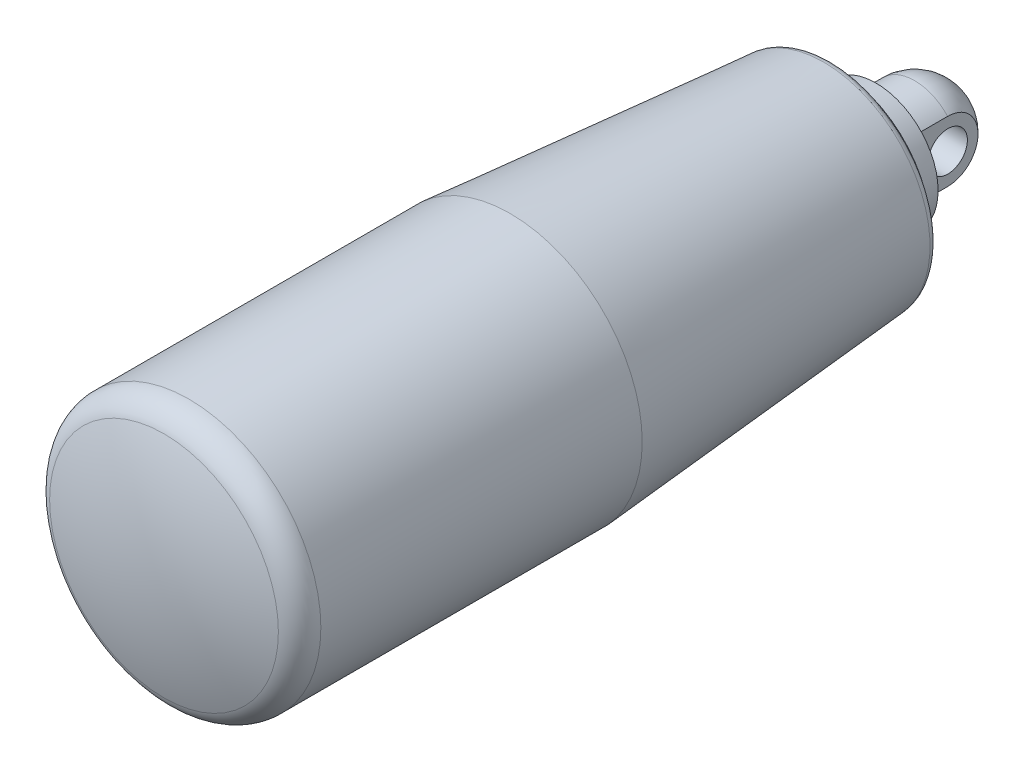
ISO-10303-21;
HEADER;
FILE_DESCRIPTION(('STEP AP214'),'2;1');
FILE_NAME('part.step','',(''),(''),'','','');
FILE_SCHEMA(('AUTOMOTIVE_DESIGN { 1 0 10303 214 1 1 1 1 }'));
ENDSEC;
DATA;
#1=APPLICATION_CONTEXT('core data for automotive mechanical design processes');
#2=APPLICATION_PROTOCOL_DEFINITION('international standard','automotive_design',2000,#1);
#3=PRODUCT_CONTEXT('',#1,'mechanical');
#4=PRODUCT('Part','Part','',(#3));
#5=PRODUCT_RELATED_PRODUCT_CATEGORY('part','',(#4));
#6=PRODUCT_DEFINITION_FORMATION('','',#4);
#7=PRODUCT_DEFINITION_CONTEXT('part definition',#1,'design');
#8=PRODUCT_DEFINITION('design','',#6,#7);
#9=PRODUCT_DEFINITION_SHAPE('','',#8);
#10=(LENGTH_UNIT() NAMED_UNIT(*) SI_UNIT(.MILLI.,.METRE.));
#11=(NAMED_UNIT(*) PLANE_ANGLE_UNIT() SI_UNIT($,.RADIAN.));
#12=(NAMED_UNIT(*) SI_UNIT($,.STERADIAN.) SOLID_ANGLE_UNIT());
#13=UNCERTAINTY_MEASURE_WITH_UNIT(LENGTH_MEASURE(1.E-05),#10,'distance_accuracy_value','');
#14=(GEOMETRIC_REPRESENTATION_CONTEXT(3) GLOBAL_UNCERTAINTY_ASSIGNED_CONTEXT((#13)) GLOBAL_UNIT_ASSIGNED_CONTEXT((#10,
#11,#12)) REPRESENTATION_CONTEXT('',''));
#15=CARTESIAN_POINT('',(0.,0.,0.));
#16=DIRECTION('',(0.,0.,1.));
#17=DIRECTION('',(1.,0.,0.));
#18=AXIS2_PLACEMENT_3D('',#15,#16,#17);
#19=CARTESIAN_POINT('',(16.,0.,0.));
#20=DIRECTION('',(1.,0.,0.));
#21=DIRECTION('',(0.,1.,0.));
#22=AXIS2_PLACEMENT_3D('',#19,#20,#21);
#23=CYLINDRICAL_SURFACE('',#22,1.6);
#24=CARTESIAN_POINT('',(-2.6875,0.,0.));
#25=DIRECTION('',(1.,0.,0.));
#26=DIRECTION('',(0.,1.,0.));
#27=AXIS2_PLACEMENT_3D('',#24,#25,#26);
#28=CIRCLE('',#27,1.6);
#29=CARTESIAN_POINT('',(-2.6875,1.6,0.));
#30=VERTEX_POINT('',#29);
#31=EDGE_CURVE('E86',#30,#30,#28,.F.);
#32=ORIENTED_EDGE('',*,*,#31,.T.);
#33=EDGE_LOOP('',(#32));
#34=FACE_BOUND('',#33,.T.);
#35=CARTESIAN_POINT('',(2.6875,0.,0.));
#36=DIRECTION('',(1.,0.,0.));
#37=DIRECTION('',(0.,1.,0.));
#38=AXIS2_PLACEMENT_3D('',#35,#36,#37);
#39=CIRCLE('',#38,1.6);
#40=CARTESIAN_POINT('',(2.6875,1.6,0.));
#41=VERTEX_POINT('',#40);
#42=EDGE_CURVE('E19',#41,#41,#39,.F.);
#43=ORIENTED_EDGE('',*,*,#42,.F.);
#44=EDGE_LOOP('',(#43));
#45=FACE_BOUND('',#44,.T.);
#46=ADVANCED_FACE('F14',(#34,#45),#23,.F.);
#47=CARTESIAN_POINT('',(0.0099999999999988,0.,0.00999999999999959));
#48=DIRECTION('',(0.,-1.,0.));
#49=DIRECTION('',(1.,0.,0.));
#50=AXIS2_PLACEMENT_3D('',#47,#48,#49);
#51=CIRCLE('',#50,3.645);
#52=TRIMMED_CURVE('',#51,(PARAMETER_VALUE(-1.57353981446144)),
(PARAMETER_VALUE(1.57353981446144)),.T.,.PARAMETER.);
#53=CARTESIAN_POINT('',(0.,0.,0.00999999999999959));
#54=DIRECTION('',(0.,0.,1.));
#55=AXIS1_PLACEMENT('',#53,#54);
#56=SURFACE_OF_REVOLUTION('',#52,#55);
#57=CARTESIAN_POINT('',(0.,0.,-3.63498628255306));
#58=VERTEX_POINT('',#57);
#59=VERTEX_LOOP('',#58);
#60=FACE_BOUND('',#59,.T.);
#61=CARTESIAN_POINT('',(0.,0.,0.00999999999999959));
#62=DIRECTION('',(0.,0.,-1.));
#63=DIRECTION('',(0.,1.,0.));
#64=AXIS2_PLACEMENT_3D('',#61,#62,#63);
#65=CIRCLE('',#64,3.655);
#66=CARTESIAN_POINT('',(2.6875,2.47716950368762,0.00999999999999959));
#67=VERTEX_POINT('',#66);
#68=CARTESIAN_POINT('',(-2.6875,2.47716950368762,0.00999999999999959));
#69=VERTEX_POINT('',#68);
#70=EDGE_CURVE('E64',#67,#69,#65,.F.);
#71=ORIENTED_EDGE('',*,*,#70,.F.);
#72=CARTESIAN_POINT('',(2.6875,-2.47716950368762,0.00999999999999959));
#73=CARTESIAN_POINT('',(2.6875,-2.47716906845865,-0.059538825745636));
#74=CARTESIAN_POINT('',(2.6875,-2.47423149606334,-0.129044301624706));
#75=CARTESIAN_POINT('',(2.6875,-2.46251252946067,-0.267557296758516));
#76=CARTESIAN_POINT('',(2.6875,-2.45373142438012,-0.336564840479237));
#77=CARTESIAN_POINT('',(2.6875,-2.41870595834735,-0.541981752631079));
#78=CARTESIAN_POINT('',(2.6875,-2.38377921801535,-0.677013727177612));
#79=CARTESIAN_POINT('',(2.6875,-2.2917478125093,-0.939287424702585));
#80=CARTESIAN_POINT('',(2.6875,-2.23463300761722,-1.06652555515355));
#81=CARTESIAN_POINT('',(2.6875,-2.09986188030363,-1.30960204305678));
#82=CARTESIAN_POINT('',(2.6875,-2.02220951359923,-1.42544258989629));
#83=CARTESIAN_POINT('',(2.6875,-1.84856279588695,-1.64246042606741));
#84=CARTESIAN_POINT('',(2.6875,-1.75256642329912,-1.74363609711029));
#85=CARTESIAN_POINT('',(2.6875,-1.54495282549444,-1.92847406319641));
#86=CARTESIAN_POINT('',(2.6875,-1.43333317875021,-2.01213363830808));
#87=CARTESIAN_POINT('',(2.6875,-1.19752221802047,-2.15964969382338));
#88=CARTESIAN_POINT('',(2.6875,-1.07331690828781,-2.22348379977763));
#89=CARTESIAN_POINT('',(2.6875,-0.815973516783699,-2.32943119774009));
#90=CARTESIAN_POINT('',(2.6875,-0.68283589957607,-2.37154561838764));
#91=CARTESIAN_POINT('',(2.6875,-0.411148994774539,-2.43294193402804));
#92=CARTESIAN_POINT('',(2.6875,-0.272590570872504,-2.45218340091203));
#93=CARTESIAN_POINT('',(2.6875,0.00579485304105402,-2.46716470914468));
#94=CARTESIAN_POINT('',(2.6875,0.145621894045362,-2.46290378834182));
#95=CARTESIAN_POINT('',(2.6875,0.422756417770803,-2.43097653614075));
#96=CARTESIAN_POINT('',(2.6875,0.56006052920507,-2.40328092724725));
#97=CARTESIAN_POINT('',(2.6875,0.828064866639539,-2.32521746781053));
#98=CARTESIAN_POINT('',(2.6875,0.958765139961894,-2.2748497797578));
#99=CARTESIAN_POINT('',(2.6875,1.20976277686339,-2.15289122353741));
#100=CARTESIAN_POINT('',(2.6875,1.33006623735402,-2.08131290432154));
#101=CARTESIAN_POINT('',(2.6875,1.55691443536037,-1.91894426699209));
#102=CARTESIAN_POINT('',(2.6875,1.66345996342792,-1.8281550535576));
#103=CARTESIAN_POINT('',(2.6875,1.8595640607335,-1.63012675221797));
#104=CARTESIAN_POINT('',(2.6875,1.94915423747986,-1.52291896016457));
#105=CARTESIAN_POINT('',(2.6875,2.10906212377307,-1.29492415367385));
#106=CARTESIAN_POINT('',(2.6875,2.17937382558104,-1.17413292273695));
#107=CARTESIAN_POINT('',(2.6875,2.29862404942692,-0.922573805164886));
#108=CARTESIAN_POINT('',(2.6875,2.34758013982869,-0.791814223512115));
#109=CARTESIAN_POINT('',(2.6875,2.42275064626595,-0.524030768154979));
#110=CARTESIAN_POINT('',(2.6875,2.44900001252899,-0.387016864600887));
#111=CARTESIAN_POINT('',(2.6875,2.46809908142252,-0.205911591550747));
#112=CARTESIAN_POINT('',(2.6875,2.47150227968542,-0.162761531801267));
#113=CARTESIAN_POINT('',(2.6875,2.47603438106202,-0.076413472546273));
#114=CARTESIAN_POINT('',(2.6875,2.47716702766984,-0.0332156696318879));
#115=CARTESIAN_POINT('',(2.6875,2.47716950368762,0.00999999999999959));
#116=B_SPLINE_CURVE_WITH_KNOTS('',3,(#72,#73,#74,#75,#76,#77,#78,#79,#80,#81,#82,#83,#84,#85,
#86,#87,#88,#89,#90,#91,#92,#93,#94,#95,#96,#97,#98,#99,#100,#101,#102,#103,#104,#105,#106,#107,
#108,#109,#110,#111,#112,#113,#114,#115),.UNSPECIFIED.,.F.,.F.,(4,2,2,2,2,2,2,2,2,2,2,2,2,2,2,2,
2,2,2,2,2,4),(0.,0.208488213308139,0.416966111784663,0.833245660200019,1.24971566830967,
1.66610551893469,2.08254128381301,2.49904166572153,2.91601040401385,3.33295747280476,
3.75064040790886,4.1683368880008,4.58655597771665,5.00477207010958,5.42274122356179,
5.84068634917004,6.25784451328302,6.67513252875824,7.09207660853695,7.5083777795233,
7.63818841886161,7.76778486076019),.UNSPECIFIED.);
#117=CARTESIAN_POINT('',(2.6875,-2.47716950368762,0.00999999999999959));
#118=VERTEX_POINT('',#117);
#119=EDGE_CURVE('E57',#118,#67,#116,.T.);
#120=ORIENTED_EDGE('',*,*,#119,.F.);
#121=CARTESIAN_POINT('',(0.,0.,0.00999999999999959));
#122=DIRECTION('',(0.,0.,-1.));
#123=DIRECTION('',(0.,1.,0.));
#124=AXIS2_PLACEMENT_3D('',#121,#122,#123);
#125=CIRCLE('',#124,3.655);
#126=CARTESIAN_POINT('',(-2.6875,-2.47716950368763,0.00999999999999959));
#127=VERTEX_POINT('',#126);
#128=EDGE_CURVE('E89',#127,#118,#125,.F.);
#129=ORIENTED_EDGE('',*,*,#128,.F.);
#130=CARTESIAN_POINT('',(-2.6875,-2.47716950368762,0.00999999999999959));
#131=CARTESIAN_POINT('',(-2.6875,-2.47716906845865,-0.0595388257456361));
#132=CARTESIAN_POINT('',(-2.6875,-2.47423149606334,-0.129044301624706));
#133=CARTESIAN_POINT('',(-2.6875,-2.46251252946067,-0.267557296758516));
#134=CARTESIAN_POINT('',(-2.6875,-2.45373142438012,-0.336564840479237));
#135=CARTESIAN_POINT('',(-2.6875,-2.41870595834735,-0.541981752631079));
#136=CARTESIAN_POINT('',(-2.6875,-2.38377921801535,-0.677013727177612));
#137=CARTESIAN_POINT('',(-2.6875,-2.2917478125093,-0.939287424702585));
#138=CARTESIAN_POINT('',(-2.6875,-2.23463300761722,-1.06652555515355));
#139=CARTESIAN_POINT('',(-2.6875,-2.09986188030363,-1.30960204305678));
#140=CARTESIAN_POINT('',(-2.6875,-2.02220951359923,-1.42544258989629));
#141=CARTESIAN_POINT('',(-2.6875,-1.84856279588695,-1.64246042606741));
#142=CARTESIAN_POINT('',(-2.6875,-1.75256642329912,-1.74363609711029));
#143=CARTESIAN_POINT('',(-2.6875,-1.54495282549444,-1.92847406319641));
#144=CARTESIAN_POINT('',(-2.6875,-1.43333317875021,-2.01213363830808));
#145=CARTESIAN_POINT('',(-2.6875,-1.19752221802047,-2.15964969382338));
#146=CARTESIAN_POINT('',(-2.6875,-1.07331690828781,-2.22348379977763));
#147=CARTESIAN_POINT('',(-2.6875,-0.8159735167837,-2.32943119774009));
#148=CARTESIAN_POINT('',(-2.6875,-0.682835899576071,-2.37154561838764));
#149=CARTESIAN_POINT('',(-2.6875,-0.41114899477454,-2.43294193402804));
#150=CARTESIAN_POINT('',(-2.6875,-0.272590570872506,-2.45218340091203));
#151=CARTESIAN_POINT('',(-2.6875,0.00579485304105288,-2.46716470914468));
#152=CARTESIAN_POINT('',(-2.6875,0.145621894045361,-2.46290378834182));
#153=CARTESIAN_POINT('',(-2.6875,0.422756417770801,-2.43097653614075));
#154=CARTESIAN_POINT('',(-2.6875,0.560060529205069,-2.40328092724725));
#155=CARTESIAN_POINT('',(-2.6875,0.828064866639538,-2.32521746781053));
#156=CARTESIAN_POINT('',(-2.6875,0.958765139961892,-2.2748497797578));
#157=CARTESIAN_POINT('',(-2.6875,1.20976277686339,-2.15289122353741));
#158=CARTESIAN_POINT('',(-2.6875,1.33006623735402,-2.08131290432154));
#159=CARTESIAN_POINT('',(-2.6875,1.55691443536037,-1.91894426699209));
#160=CARTESIAN_POINT('',(-2.6875,1.66345996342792,-1.8281550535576));
#161=CARTESIAN_POINT('',(-2.6875,1.8595640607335,-1.63012675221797));
#162=CARTESIAN_POINT('',(-2.6875,1.94915423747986,-1.52291896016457));
#163=CARTESIAN_POINT('',(-2.6875,2.10906212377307,-1.29492415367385));
#164=CARTESIAN_POINT('',(-2.6875,2.17937382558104,-1.17413292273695));
#165=CARTESIAN_POINT('',(-2.6875,2.29862404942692,-0.922573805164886));
#166=CARTESIAN_POINT('',(-2.6875,2.34758013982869,-0.791814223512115));
#167=CARTESIAN_POINT('',(-2.6875,2.42275064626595,-0.524030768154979));
#168=CARTESIAN_POINT('',(-2.6875,2.44900001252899,-0.387016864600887));
#169=CARTESIAN_POINT('',(-2.6875,2.46809908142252,-0.205911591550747));
#170=CARTESIAN_POINT('',(-2.6875,2.47150227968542,-0.162761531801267));
#171=CARTESIAN_POINT('',(-2.6875,2.47603438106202,-0.076413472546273));
#172=CARTESIAN_POINT('',(-2.6875,2.47716702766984,-0.0332156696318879));
#173=CARTESIAN_POINT('',(-2.6875,2.47716950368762,0.00999999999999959));
#174=B_SPLINE_CURVE_WITH_KNOTS('',3,(#130,#131,#132,#133,#134,#135,#136,#137,#138,#139,#140,
#141,#142,#143,#144,#145,#146,#147,#148,#149,#150,#151,#152,#153,#154,#155,#156,#157,#158,#159,
#160,#161,#162,#163,#164,#165,#166,#167,#168,#169,#170,#171,#172,#173),.UNSPECIFIED.,.F.,.F.,(4,
2,2,2,2,2,2,2,2,2,2,2,2,2,2,2,2,2,2,2,2,4),(0.,0.208488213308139,0.416966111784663,
0.833245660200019,1.24971566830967,1.66610551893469,2.08254128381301,2.49904166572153,
2.91601040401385,3.33295747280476,3.75064040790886,4.1683368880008,4.58655597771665,
5.00477207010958,5.42274122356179,5.84068634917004,6.25784451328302,6.67513252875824,
7.09207660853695,7.5083777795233,7.63818841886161,7.76778486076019),.UNSPECIFIED.);
#175=EDGE_CURVE('E67',#127,#69,#174,.T.);
#176=ORIENTED_EDGE('',*,*,#175,.T.);
#177=EDGE_LOOP('',(#71,#120,#129,#176));
#178=FACE_BOUND('',#177,.T.);
#179=ADVANCED_FACE('F16',(#60,#178),#56,.T.);
#180=CARTESIAN_POINT('',(2.6875,0.,-8.25));
#181=DIRECTION('',(1.,0.,0.));
#182=DIRECTION('',(0.,1.,0.));
#183=AXIS2_PLACEMENT_3D('',#180,#181,#182);
#184=PLANE('',#183);
#185=DIRECTION('',(0.,0.,-1.));
#186=VECTOR('',#185,1.);
#187=CARTESIAN_POINT('',(2.6875,-2.47716950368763,-3.63498628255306));
#188=LINE('',#187,#186);
#189=CARTESIAN_POINT('',(2.6875,-2.47716950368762,3.15));
#190=VERTEX_POINT('',#189);
#191=EDGE_CURVE('E87',#118,#190,#188,.F.);
#192=ORIENTED_EDGE('',*,*,#191,.F.);
#193=ORIENTED_EDGE('',*,*,#119,.T.);
#194=DIRECTION('',(0.,0.,-1.));
#195=VECTOR('',#194,1.);
#196=CARTESIAN_POINT('',(2.6875,2.47716950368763,-3.63498628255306));
#197=LINE('',#196,#195);
#198=CARTESIAN_POINT('',(2.6875,2.47716950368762,3.15));
#199=VERTEX_POINT('',#198);
#200=EDGE_CURVE('E70',#199,#67,#197,.T.);
#201=ORIENTED_EDGE('',*,*,#200,.F.);
#202=DIRECTION('',(0.,-1.,0.));
#203=VECTOR('',#202,1.);
#204=CARTESIAN_POINT('',(2.6875,0.,3.15));
#205=LINE('',#204,#203);
#206=EDGE_CURVE('E69',#199,#190,#205,.T.);
#207=ORIENTED_EDGE('',*,*,#206,.T.);
#208=EDGE_LOOP('',(#192,#193,#201,#207));
#209=FACE_BOUND('',#208,.T.);
#210=ORIENTED_EDGE('',*,*,#42,.T.);
#211=EDGE_LOOP('',(#210));
#212=FACE_BOUND('',#211,.T.);
#213=ADVANCED_FACE('F62',(#209,#212),#184,.T.);
#214=CARTESIAN_POINT('',(0.,0.,-3.63498628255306));
#215=DIRECTION('',(0.,0.,-1.));
#216=DIRECTION('',(0.,1.,0.));
#217=AXIS2_PLACEMENT_3D('',#214,#215,#216);
#218=CYLINDRICAL_SURFACE('',#217,3.655);
#219=ORIENTED_EDGE('',*,*,#128,.T.);
#220=ORIENTED_EDGE('',*,*,#191,.T.);
#221=CARTESIAN_POINT('',(0.,0.,3.15));
#222=DIRECTION('',(0.,0.,-1.));
#223=DIRECTION('',(0.,1.,0.));
#224=AXIS2_PLACEMENT_3D('',#221,#222,#223);
#225=CIRCLE('',#224,3.655);
#226=CARTESIAN_POINT('',(-2.6875,-2.47716950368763,3.15));
#227=VERTEX_POINT('',#226);
#228=EDGE_CURVE('E111',#190,#227,#225,.T.);
#229=ORIENTED_EDGE('',*,*,#228,.T.);
#230=DIRECTION('',(0.,0.,1.));
#231=VECTOR('',#230,1.);
#232=CARTESIAN_POINT('',(-2.6875,-2.47716950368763,-8.25));
#233=LINE('',#232,#231);
#234=EDGE_CURVE('E83',#227,#127,#233,.F.);
#235=ORIENTED_EDGE('',*,*,#234,.T.);
#236=EDGE_LOOP('',(#219,#220,#229,#235));
#237=FACE_BOUND('',#236,.T.);
#238=ADVANCED_FACE('F124',(#237),#218,.T.);
#239=CARTESIAN_POINT('',(-2.6875,0.,-8.25));
#240=DIRECTION('',(1.,0.,0.));
#241=DIRECTION('',(0.,1.,0.));
#242=AXIS2_PLACEMENT_3D('',#239,#240,#241);
#243=PLANE('',#242);
#244=DIRECTION('',(0.,0.,-1.));
#245=VECTOR('',#244,1.);
#246=CARTESIAN_POINT('',(-2.6875,2.47716950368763,-3.63498628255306));
#247=LINE('',#246,#245);
#248=CARTESIAN_POINT('',(-2.6875,2.47716950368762,3.15));
#249=VERTEX_POINT('',#248);
#250=EDGE_CURVE('E78',#69,#249,#247,.F.);
#251=ORIENTED_EDGE('',*,*,#250,.F.);
#252=ORIENTED_EDGE('',*,*,#175,.F.);
#253=ORIENTED_EDGE('',*,*,#234,.F.);
#254=DIRECTION('',(0.,-1.,0.));
#255=VECTOR('',#254,1.);
#256=CARTESIAN_POINT('',(-2.6875,0.,3.15));
#257=LINE('',#256,#255);
#258=EDGE_CURVE('E34',#227,#249,#257,.F.);
#259=ORIENTED_EDGE('',*,*,#258,.T.);
#260=EDGE_LOOP('',(#251,#252,#253,#259));
#261=FACE_BOUND('',#260,.T.);
#262=ORIENTED_EDGE('',*,*,#31,.F.);
#263=EDGE_LOOP('',(#262));
#264=FACE_BOUND('',#263,.T.);
#265=ADVANCED_FACE('F119',(#261,#264),#243,.F.);
#266=CARTESIAN_POINT('',(0.,0.,-3.63498628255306));
#267=DIRECTION('',(0.,0.,-1.));
#268=DIRECTION('',(0.,1.,0.));
#269=AXIS2_PLACEMENT_3D('',#266,#267,#268);
#270=CYLINDRICAL_SURFACE('',#269,3.655);
#271=ORIENTED_EDGE('',*,*,#200,.T.);
#272=ORIENTED_EDGE('',*,*,#70,.T.);
#273=ORIENTED_EDGE('',*,*,#250,.T.);
#274=CARTESIAN_POINT('',(0.,0.,3.15));
#275=DIRECTION('',(0.,0.,-1.));
#276=DIRECTION('',(0.,1.,0.));
#277=AXIS2_PLACEMENT_3D('',#274,#275,#276);
#278=CIRCLE('',#277,3.655);
#279=EDGE_CURVE('E75',#249,#199,#278,.T.);
#280=ORIENTED_EDGE('',*,*,#279,.T.);
#281=EDGE_LOOP('',(#271,#272,#273,#280));
#282=FACE_BOUND('',#281,.T.);
#283=ADVANCED_FACE('F73',(#282),#270,.T.);
#284=CARTESIAN_POINT('',(0.,0.,3.15));
#285=DIRECTION('',(0.,0.,1.));
#286=DIRECTION('',(0.,-1.,0.));
#287=AXIS2_PLACEMENT_3D('',#284,#285,#286);
#288=PLANE('',#287);
#289=ORIENTED_EDGE('',*,*,#258,.F.);
#290=ORIENTED_EDGE('',*,*,#228,.F.);
#291=ORIENTED_EDGE('',*,*,#206,.F.);
#292=ORIENTED_EDGE('',*,*,#279,.F.);
#293=EDGE_LOOP('',(#289,#290,#291,#292));
#294=FACE_BOUND('',#293,.T.);
#295=CARTESIAN_POINT('',(0.,0.,3.14999999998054));
#296=DIRECTION('',(0.,0.,1.));
#297=DIRECTION('',(1.,0.,0.));
#298=AXIS2_PLACEMENT_3D('',#295,#296,#297);
#299=CIRCLE('',#298,5.04917687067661);
#300=CARTESIAN_POINT('',(5.04917687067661,0.,3.14999999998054));
#301=VERTEX_POINT('',#300);
#302=EDGE_CURVE('E107',#301,#301,#299,.T.);
#303=ORIENTED_EDGE('',*,*,#302,.F.);
#304=EDGE_LOOP('',(#303));
#305=FACE_BOUND('',#304,.T.);
#306=ADVANCED_FACE('F210',(#294,#305),#288,.F.);
#307=CARTESIAN_POINT('',(0.,0.,6.2499999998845));
#308=DIRECTION('',(0.,0.,1.));
#309=DIRECTION('',(1.,0.,0.));
#310=AXIS2_PLACEMENT_3D('',#307,#308,#309);
#311=CONICAL_SURFACE('',#310,5.37499999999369,0.104719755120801);
#312=ORIENTED_EDGE('',*,*,#302,.T.);
#313=EDGE_LOOP('',(#312));
#314=FACE_BOUND('',#313,.T.);
#315=CARTESIAN_POINT('',(0.,0.,6.24999999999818));
#316=DIRECTION('',(0.,0.,1.));
#317=DIRECTION('',(1.,0.,0.));
#318=AXIS2_PLACEMENT_3D('',#315,#316,#317);
#319=CIRCLE('',#318,5.37500000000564);
#320=CARTESIAN_POINT('',(5.37500000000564,0.,6.24999999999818));
#321=VERTEX_POINT('',#320);
#322=EDGE_CURVE('E104',#321,#321,#319,.F.);
#323=ORIENTED_EDGE('',*,*,#322,.T.);
#324=EDGE_LOOP('',(#323));
#325=FACE_BOUND('',#324,.T.);
#326=ADVANCED_FACE('F213',(#314,#325),#311,.T.);
#327=CARTESIAN_POINT('',(0.,-5.375,6.25));
#328=DIRECTION('',(0.,0.,1.));
#329=DIRECTION('',(0.,-1.,0.));
#330=AXIS2_PLACEMENT_3D('',#327,#328,#329);
#331=PLANE('',#330);
#332=ORIENTED_EDGE('',*,*,#322,.F.);
#333=EDGE_LOOP('',(#332));
#334=FACE_BOUND('',#333,.T.);
#335=CARTESIAN_POINT('',(0.,0.,6.25));
#336=DIRECTION('',(0.,0.,-1.));
#337=DIRECTION('',(0.,1.,0.));
#338=AXIS2_PLACEMENT_3D('',#335,#336,#337);
#339=CIRCLE('',#338,7.525);
#340=CARTESIAN_POINT('',(0.,7.525,6.25));
#341=VERTEX_POINT('',#340);
#342=EDGE_CURVE('E101',#341,#341,#339,.F.);
#343=ORIENTED_EDGE('',*,*,#342,.F.);
#344=EDGE_LOOP('',(#343));
#345=FACE_BOUND('',#344,.T.);
#346=ADVANCED_FACE('F218',(#334,#345),#331,.F.);
#347=CARTESIAN_POINT('',(0.,0.,62.75));
#348=DIRECTION('',(0.,0.,-1.));
#349=DIRECTION('',(0.,1.,0.));
#350=AXIS2_PLACEMENT_3D('',#347,#348,#349);
#351=CYLINDRICAL_SURFACE('',#350,7.525);
#352=ORIENTED_EDGE('',*,*,#342,.T.);
#353=EDGE_LOOP('',(#352));
#354=FACE_BOUND('',#353,.T.);
#355=CARTESIAN_POINT('',(0.,0.,6.75));
#356=DIRECTION('',(0.,0.,-1.));
#357=DIRECTION('',(0.,1.,0.));
#358=AXIS2_PLACEMENT_3D('',#355,#356,#357);
#359=CIRCLE('',#358,7.525);
#360=CARTESIAN_POINT('',(0.,7.525,6.75));
#361=VERTEX_POINT('',#360);
#362=EDGE_CURVE('E98',#361,#361,#359,.T.);
#363=ORIENTED_EDGE('',*,*,#362,.T.);
#364=EDGE_LOOP('',(#363));
#365=FACE_BOUND('',#364,.T.);
#366=ADVANCED_FACE('F186',(#354,#365),#351,.T.);
#367=CARTESIAN_POINT('',(0.,-7.525,6.75));
#368=DIRECTION('',(0.,0.,1.));
#369=DIRECTION('',(0.,-1.,0.));
#370=AXIS2_PLACEMENT_3D('',#367,#368,#369);
#371=PLANE('',#370);
#372=ORIENTED_EDGE('',*,*,#362,.F.);
#373=EDGE_LOOP('',(#372));
#374=FACE_BOUND('',#373,.T.);
#375=CARTESIAN_POINT('',(0.,0.,6.75000000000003));
#376=DIRECTION('',(0.,0.,1.));
#377=DIRECTION('',(0.,-1.,0.));
#378=AXIS2_PLACEMENT_3D('',#375,#376,#377);
#379=CIRCLE('',#378,7.93973479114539);
#380=CARTESIAN_POINT('',(0.,-7.93973479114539,6.75000000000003));
#381=VERTEX_POINT('',#380);
#382=EDGE_CURVE('E97',#381,#381,#379,.T.);
#383=ORIENTED_EDGE('',*,*,#382,.F.);
#384=EDGE_LOOP('',(#383));
#385=FACE_BOUND('',#384,.T.);
#386=ADVANCED_FACE('F181',(#374,#385),#371,.F.);
#387=CARTESIAN_POINT('',(0.,0.,34.8));
#388=DIRECTION('',(0.,1.,0.));
#389=DIRECTION('',(-1.,0.,0.));
#390=AXIS2_PLACEMENT_3D('',#387,#388,#389);
#391=SPHERICAL_SURFACE('',#390,27.95);
#392=CARTESIAN_POINT('',(0.,0.,61.1515127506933));
#393=DIRECTION('',(0.,0.,1.));
#394=DIRECTION('',(0.,-1.,0.));
#395=AXIS2_PLACEMENT_3D('',#392,#393,#394);
#396=CIRCLE('',#395,9.31666655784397);
#397=CARTESIAN_POINT('',(0.,-9.31666655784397,61.1515127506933));
#398=VERTEX_POINT('',#397);
#399=EDGE_CURVE('E93',#398,#398,#396,.F.);
#400=ORIENTED_EDGE('',*,*,#399,.F.);
#401=EDGE_LOOP('',(#400));
#402=FACE_BOUND('',#401,.T.);
#403=ADVANCED_FACE('F178',(#402),#391,.T.);
#404=CARTESIAN_POINT('',(0.,0.,7.4666666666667));
#405=DIRECTION('',(0.,0.,1.));
#406=DIRECTION('',(0.,-1.,0.));
#407=AXIS2_PLACEMENT_3D('',#404,#405,#406);
#408=TOROIDAL_SURFACE('',#407,7.93973479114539,0.716666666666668);
#409=CARTESIAN_POINT('',(0.,0.,7.408053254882));
#410=DIRECTION('',(0.,0.,1.));
#411=DIRECTION('',(0.,-1.,0.));
#412=AXIS2_PLACEMENT_3D('',#409,#410,#411);
#413=CIRCLE('',#412,8.65400055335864);
#414=CARTESIAN_POINT('',(0.,-8.65400055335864,7.408053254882));
#415=VERTEX_POINT('',#414);
#416=EDGE_CURVE('E96',#415,#415,#413,.T.);
#417=ORIENTED_EDGE('',*,*,#416,.F.);
#418=EDGE_LOOP('',(#417));
#419=FACE_BOUND('',#418,.T.);
#420=ORIENTED_EDGE('',*,*,#382,.T.);
#421=EDGE_LOOP('',(#420));
#422=FACE_BOUND('',#421,.T.);
#423=ADVANCED_FACE('F163',(#419,#422),#408,.T.);
#424=CARTESIAN_POINT('',(0.,0.,59.1244732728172));
#425=DIRECTION('',(0.,0.,1.));
#426=DIRECTION('',(0.,-1.,0.));
#427=AXIS2_PLACEMENT_3D('',#424,#425,#426);
#428=TOROIDAL_SURFACE('',#427,8.6,2.15);
#429=ORIENTED_EDGE('',*,*,#399,.T.);
#430=EDGE_LOOP('',(#429));
#431=FACE_BOUND('',#430,.T.);
#432=CARTESIAN_POINT('',(0.,0.,59.1244732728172));
#433=DIRECTION('',(0.,0.,-1.));
#434=DIRECTION('',(0.,1.,0.));
#435=AXIS2_PLACEMENT_3D('',#432,#433,#434);
#436=CIRCLE('',#435,10.75);
#437=CARTESIAN_POINT('',(0.,10.75,59.1244732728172));
#438=VERTEX_POINT('',#437);
#439=EDGE_CURVE('E25',#438,#438,#436,.T.);
#440=ORIENTED_EDGE('',*,*,#439,.F.);
#441=EDGE_LOOP('',(#440));
#442=FACE_BOUND('',#441,.T.);
#443=ADVANCED_FACE('F155',(#431,#442),#428,.T.);
#444=CARTESIAN_POINT('',(0.,0.,32.95));
#445=DIRECTION('',(0.,0.,1.));
#446=DIRECTION('',(1.,0.,0.));
#447=AXIS2_PLACEMENT_3D('',#444,#445,#446);
#448=CONICAL_SURFACE('',#447,10.75,0.0818776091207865);
#449=ORIENTED_EDGE('',*,*,#416,.T.);
#450=EDGE_LOOP('',(#449));
#451=FACE_BOUND('',#450,.T.);
#452=CARTESIAN_POINT('',(0.,0.,32.95));
#453=DIRECTION('',(0.,0.,-1.));
#454=DIRECTION('',(0.,1.,0.));
#455=AXIS2_PLACEMENT_3D('',#452,#453,#454);
#456=CIRCLE('',#455,10.75);
#457=CARTESIAN_POINT('',(0.,10.75,32.95));
#458=VERTEX_POINT('',#457);
#459=EDGE_CURVE('E9',#458,#458,#456,.F.);
#460=ORIENTED_EDGE('',*,*,#459,.F.);
#461=EDGE_LOOP('',(#460));
#462=FACE_BOUND('',#461,.T.);
#463=ADVANCED_FACE('F148',(#451,#462),#448,.T.);
#464=CARTESIAN_POINT('',(0.,0.,62.75));
#465=DIRECTION('',(0.,0.,-1.));
#466=DIRECTION('',(0.,1.,0.));
#467=AXIS2_PLACEMENT_3D('',#464,#465,#466);
#468=CYLINDRICAL_SURFACE('',#467,10.75);
#469=ORIENTED_EDGE('',*,*,#459,.T.);
#470=EDGE_LOOP('',(#469));
#471=FACE_BOUND('',#470,.T.);
#472=ORIENTED_EDGE('',*,*,#439,.T.);
#473=EDGE_LOOP('',(#472));
#474=FACE_BOUND('',#473,.T.);
#475=ADVANCED_FACE('F146',(#471,#474),#468,.T.);
#476=CLOSED_SHELL('',(#46,#179,#213,#238,#265,#283,#306,#326,#346,#366,#386,#403,#423,#443,#463,#475));
#477=MANIFOLD_SOLID_BREP('B1',#476);
#478=ADVANCED_BREP_SHAPE_REPRESENTATION('',(#18,#477),#14);
#479=SHAPE_DEFINITION_REPRESENTATION(#9,#478);
ENDSEC;
END-ISO-10303-21;
